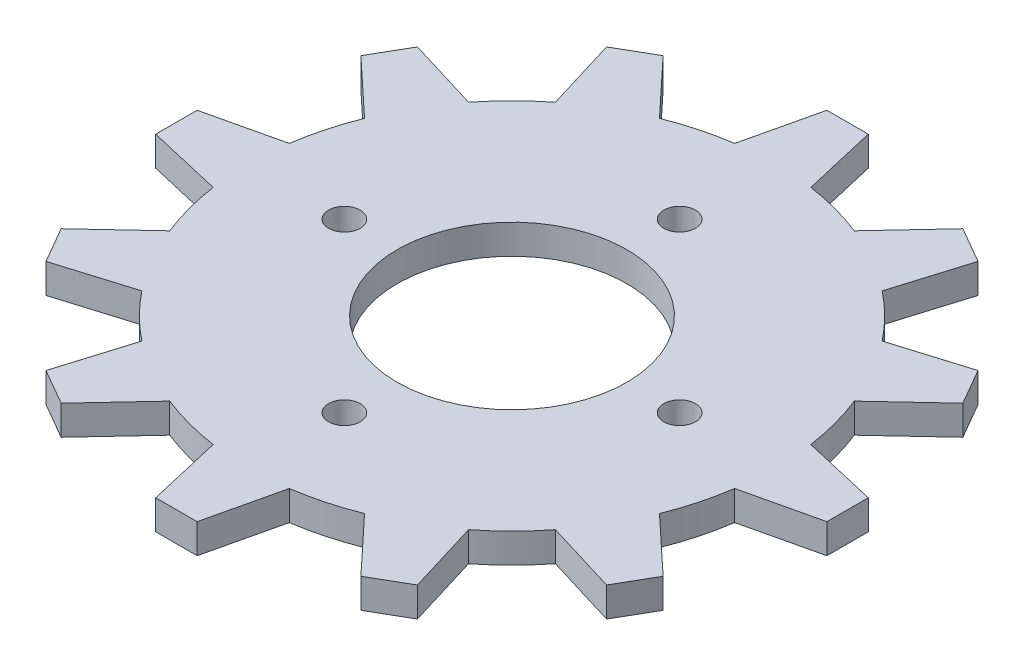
from build123d import *

# Parameters (mm, degrees)
SKETCH2_R           = 25
BOSS_EXTRUDE1_DEPTH = 2.8
BOSS_EXTRUDE4_DEPTH = 2.8
CIRPATTERN1_COUNT   = 12
SKETCH8_R           = 10.9
SKETCH8_R_2         = 1.5
CUT_EXTRUDE1_DEPTH  = 10


with BuildPart() as part:
    # Sketch2 → Boss-Extrude1 (new body)
    with BuildSketch(Plane(origin=(0, 0, 0), x_dir=(1, 0, 0), z_dir=(0, 1, 0))):
        with Locations(Location((0, 0, 0), (0, 0, 270))):
            Circle(SKETCH2_R)
    boss_extrude1 = extrude(amount=BOSS_EXTRUDE1_DEPTH)

    # Sketch7 → Boss-Extrude4 (add)
    with BuildSketch(Plane(origin=(0, 2.8, 0), x_dir=(1, 0, 0), z_dir=(0, 1, 0))):
        Polygon((-23.06973929, 4), (-23.06973929, -4), (-31.836295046, -1.963458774), (-31.836295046, 1.963458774), align=None)
    boss_extrude4 = extrude(amount=-BOSS_EXTRUDE4_DEPTH)

    # CirPattern1: Boss-Extrude1, Boss-Extrude4 ×12 about axis
    cirpattern1_axis = Axis((0, 0, 0), (0, 1, 0))
    add([boss_extrude1.rotate(cirpattern1_axis, i * 360 / CIRPATTERN1_COUNT) for i in range(1, CIRPATTERN1_COUNT)])
    add([boss_extrude4.rotate(cirpattern1_axis, i * 360 / CIRPATTERN1_COUNT) for i in range(1, CIRPATTERN1_COUNT)])

    # Sketch8 → Cut-Extrude1 (cut)
    with BuildSketch(Plane(origin=(0, 2.8, 0), x_dir=(1, 0, 0), z_dir=(0, 1, 0))):
        with Locations(Location((0, 0, 0), (0, 0, 270))):
            Circle(SKETCH8_R)
        with Locations(Location((0, -15.9, 0), (0, 0, 270))):
            Circle(SKETCH8_R_2)
        with Locations(Location((-15.9, 0, 0), (0, 0, 270))):
            Circle(SKETCH8_R_2)
        with Locations(Location((0, 15.9, 0), (0, 0, 270))):
            Circle(SKETCH8_R_2)
        with Locations(Location((15.9, 0, 0), (0, 0, 270))):
            Circle(SKETCH8_R_2)
    extrude(amount=-CUT_EXTRUDE1_DEPTH, mode=Mode.SUBTRACT)


solid = part.part
